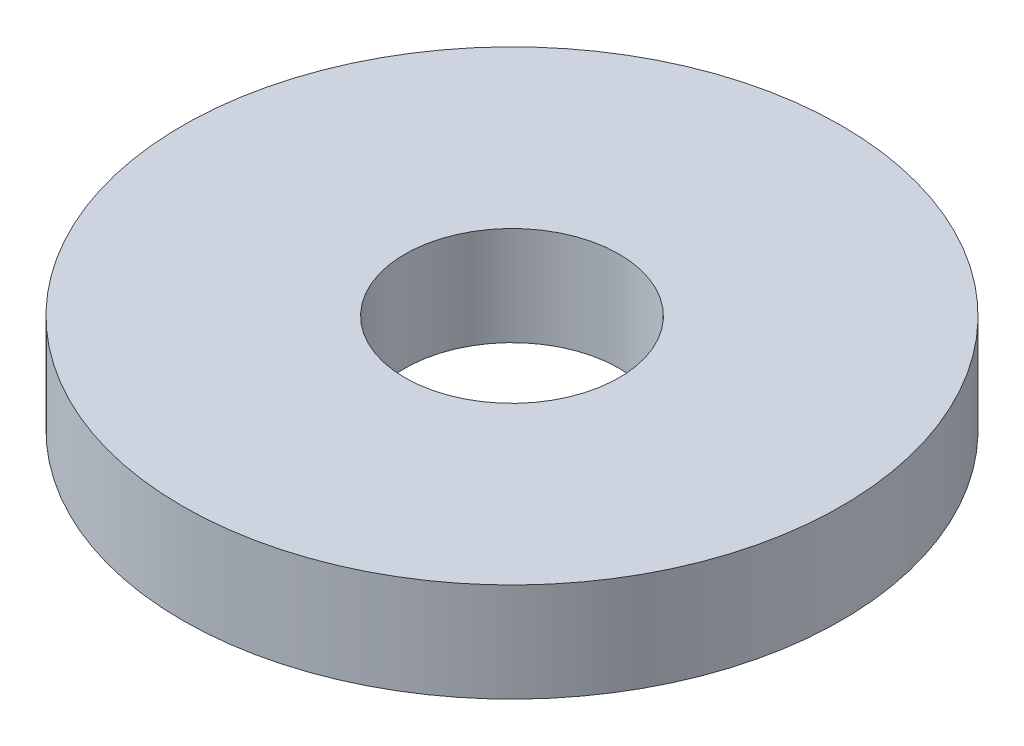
ISO-10303-21;
HEADER;
FILE_DESCRIPTION(('STEP AP214'),'2;1');
FILE_NAME('part.step','',(''),(''),'','','');
FILE_SCHEMA(('AUTOMOTIVE_DESIGN { 1 0 10303 214 1 1 1 1 }'));
ENDSEC;
DATA;
#1=APPLICATION_CONTEXT('core data for automotive mechanical design processes');
#2=APPLICATION_PROTOCOL_DEFINITION('international standard','automotive_design',2000,#1);
#3=PRODUCT_CONTEXT('',#1,'mechanical');
#4=PRODUCT('Part','Part','',(#3));
#5=PRODUCT_RELATED_PRODUCT_CATEGORY('part','',(#4));
#6=PRODUCT_DEFINITION_FORMATION('','',#4);
#7=PRODUCT_DEFINITION_CONTEXT('part definition',#1,'design');
#8=PRODUCT_DEFINITION('design','',#6,#7);
#9=PRODUCT_DEFINITION_SHAPE('','',#8);
#10=(LENGTH_UNIT() NAMED_UNIT(*) SI_UNIT(.MILLI.,.METRE.));
#11=(NAMED_UNIT(*) PLANE_ANGLE_UNIT() SI_UNIT($,.RADIAN.));
#12=(NAMED_UNIT(*) SI_UNIT($,.STERADIAN.) SOLID_ANGLE_UNIT());
#13=UNCERTAINTY_MEASURE_WITH_UNIT(LENGTH_MEASURE(1.E-05),#10,'distance_accuracy_value','');
#14=(GEOMETRIC_REPRESENTATION_CONTEXT(3) GLOBAL_UNCERTAINTY_ASSIGNED_CONTEXT((#13)) GLOBAL_UNIT_ASSIGNED_CONTEXT((#10,
#11,#12)) REPRESENTATION_CONTEXT('',''));
#15=CARTESIAN_POINT('',(0.,0.,0.));
#16=DIRECTION('',(0.,0.,1.));
#17=DIRECTION('',(1.,0.,0.));
#18=AXIS2_PLACEMENT_3D('',#15,#16,#17);
#19=CARTESIAN_POINT('',(6.66133814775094E-13,2.99999999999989,0.));
#20=DIRECTION('',(0.,1.,0.));
#21=DIRECTION('',(0.,0.,1.00000000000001));
#22=AXIS2_PLACEMENT_3D('',#19,#20,#21);
#23=PLANE('',#22);
#24=CARTESIAN_POINT('',(6.66133814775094E-13,2.99999999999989,0.));
#25=DIRECTION('',(0.,1.,0.));
#26=DIRECTION('',(0.,0.,1.00000000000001));
#27=AXIS2_PLACEMENT_3D('',#24,#25,#26);
#28=CIRCLE('',#27,10.);
#29=CARTESIAN_POINT('',(6.66133814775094E-13,2.99999999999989,10.0000000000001));
#30=VERTEX_POINT('',#29);
#31=EDGE_CURVE('E10',#30,#30,#28,.T.);
#32=ORIENTED_EDGE('',*,*,#31,.T.);
#33=EDGE_LOOP('',(#32));
#34=FACE_BOUND('',#33,.T.);
#35=CARTESIAN_POINT('',(6.66133814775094E-13,2.99999999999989,0.));
#36=DIRECTION('',(0.,1.,0.));
#37=DIRECTION('',(0.,0.,1.00000000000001));
#38=AXIS2_PLACEMENT_3D('',#35,#36,#37);
#39=CIRCLE('',#38,3.25);
#40=CARTESIAN_POINT('',(6.66133814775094E-13,2.99999999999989,3.25000000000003));
#41=VERTEX_POINT('',#40);
#42=EDGE_CURVE('E52',#41,#41,#39,.T.);
#43=ORIENTED_EDGE('',*,*,#42,.F.);
#44=EDGE_LOOP('',(#43));
#45=FACE_BOUND('',#44,.T.);
#46=ADVANCED_FACE('F38',(#34,#45),#23,.T.);
#47=CARTESIAN_POINT('',(1.66533453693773E-13,0.,0.));
#48=DIRECTION('',(0.,1.,0.));
#49=DIRECTION('',(0.,0.,1.00000000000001));
#50=AXIS2_PLACEMENT_3D('',#47,#48,#49);
#51=PLANE('',#50);
#52=CARTESIAN_POINT('',(1.66533453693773E-13,0.,0.));
#53=DIRECTION('',(0.,1.,0.));
#54=DIRECTION('',(0.,0.,1.00000000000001));
#55=AXIS2_PLACEMENT_3D('',#52,#53,#54);
#56=CIRCLE('',#55,10.);
#57=CARTESIAN_POINT('',(1.66533453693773E-13,0.,10.0000000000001));
#58=VERTEX_POINT('',#57);
#59=EDGE_CURVE('E46',#58,#58,#56,.T.);
#60=ORIENTED_EDGE('',*,*,#59,.F.);
#61=EDGE_LOOP('',(#60));
#62=FACE_BOUND('',#61,.T.);
#63=CARTESIAN_POINT('',(1.66533453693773E-13,0.,0.));
#64=DIRECTION('',(0.,1.,0.));
#65=DIRECTION('',(0.,0.,1.00000000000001));
#66=AXIS2_PLACEMENT_3D('',#63,#64,#65);
#67=CIRCLE('',#66,3.25);
#68=CARTESIAN_POINT('',(1.66533453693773E-13,0.,3.25000000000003));
#69=VERTEX_POINT('',#68);
#70=EDGE_CURVE('E57',#69,#69,#67,.T.);
#71=ORIENTED_EDGE('',*,*,#70,.T.);
#72=EDGE_LOOP('',(#71));
#73=FACE_BOUND('',#72,.T.);
#74=ADVANCED_FACE('F63',(#62,#73),#51,.F.);
#75=CARTESIAN_POINT('',(6.66133814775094E-13,2.99999999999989,0.));
#76=DIRECTION('',(0.,-1.,0.));
#77=DIRECTION('',(0.,0.,-1.00000000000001));
#78=AXIS2_PLACEMENT_3D('',#75,#76,#77);
#79=CYLINDRICAL_SURFACE('',#78,10.);
#80=ORIENTED_EDGE('',*,*,#31,.F.);
#81=EDGE_LOOP('',(#80));
#82=FACE_BOUND('',#81,.T.);
#83=ORIENTED_EDGE('',*,*,#59,.T.);
#84=EDGE_LOOP('',(#83));
#85=FACE_BOUND('',#84,.T.);
#86=ADVANCED_FACE('F40',(#82,#85),#79,.T.);
#87=CARTESIAN_POINT('',(6.66133814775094E-13,2.99999999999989,0.));
#88=DIRECTION('',(0.,-1.,0.));
#89=DIRECTION('',(0.,0.,-1.00000000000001));
#90=AXIS2_PLACEMENT_3D('',#87,#88,#89);
#91=CYLINDRICAL_SURFACE('',#90,3.25);
#92=ORIENTED_EDGE('',*,*,#42,.T.);
#93=EDGE_LOOP('',(#92));
#94=FACE_BOUND('',#93,.T.);
#95=ORIENTED_EDGE('',*,*,#70,.F.);
#96=EDGE_LOOP('',(#95));
#97=FACE_BOUND('',#96,.T.);
#98=ADVANCED_FACE('F65',(#94,#97),#91,.F.);
#99=CLOSED_SHELL('',(#46,#74,#86,#98));
#100=MANIFOLD_SOLID_BREP('B2',#99);
#101=ADVANCED_BREP_SHAPE_REPRESENTATION('',(#18,#100),#14);
#102=SHAPE_DEFINITION_REPRESENTATION(#9,#101);
ENDSEC;
END-ISO-10303-21;
